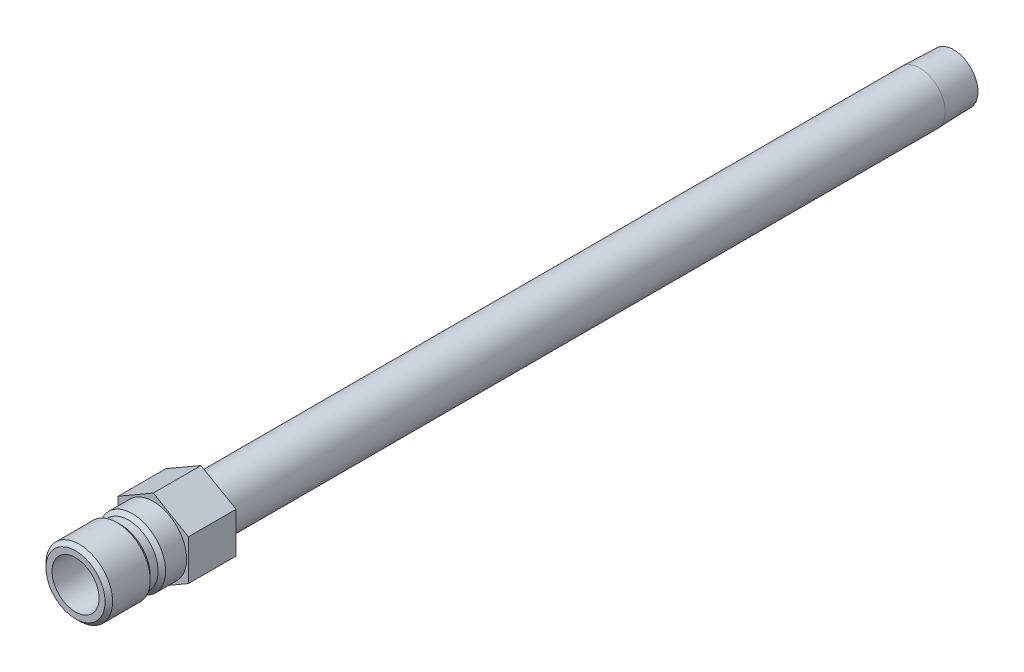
from build123d import *

# Parameters (mm, degrees)
SKETCH2_R           = 4.7625
BOSS_EXTRUDE1_DEPTH = 9.652


with BuildPart() as part:
    # Sketch1 → Revolve1 (revolve)
    with BuildSketch(Plane(origin=(0, 0, 0), x_dir=(0, 0, -1), z_dir=(1, 0, 0))):
        Polygon((-15.748, 4.7625), (-15.748, 5.9817), (-14.986, 6.7437), (-7.366, 6.7437), (-6.604, 5.9817), (-5.0165, 5.9817), (-4.2545, 6.7437), (9.652, 6.7437), (9.652, 5.1435), (155.194, 5.1435), (162.052, 4.929188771), (162.052, 3.4163), (-2.840212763, 3.4163), (-3.556, 4.7625), align=None)
    revolve(axis=Axis((0, 0, -9.652), (0, 0, 1)))

    # Sketch2 → Boss-Extrude1 (add)
    with BuildSketch(Plane.XY):
        Polygon((-7.112, 4.106115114), (-7.112, -4.106115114), (0, -8.212230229), (7.112, -4.106115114), (7.112, 4.106115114), (0, 8.212230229), align=None)
        with Locations(Location((0, 0, 0), (0, 0, 90))):
            Circle(SKETCH2_R, mode=Mode.SUBTRACT)
    extrude(amount=-BOSS_EXTRUDE1_DEPTH)


solid = part.part
